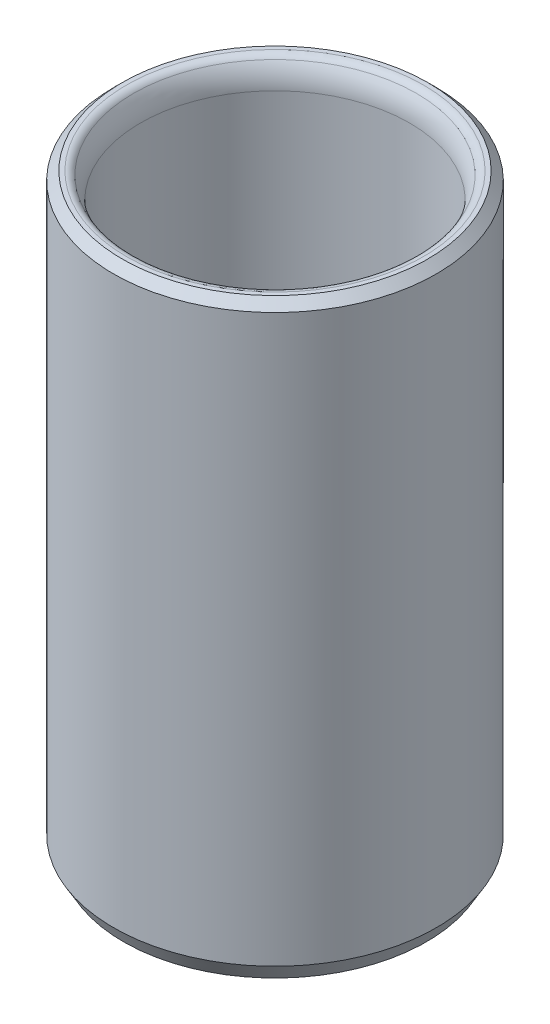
ISO-10303-21;
HEADER;
FILE_DESCRIPTION(('STEP AP214'),'2;1');
FILE_NAME('part.step','',(''),(''),'','','');
FILE_SCHEMA(('AUTOMOTIVE_DESIGN { 1 0 10303 214 1 1 1 1 }'));
ENDSEC;
DATA;
#1=APPLICATION_CONTEXT('core data for automotive mechanical design processes');
#2=APPLICATION_PROTOCOL_DEFINITION('international standard','automotive_design',2000,#1);
#3=PRODUCT_CONTEXT('',#1,'mechanical');
#4=PRODUCT('Part','Part','',(#3));
#5=PRODUCT_RELATED_PRODUCT_CATEGORY('part','',(#4));
#6=PRODUCT_DEFINITION_FORMATION('','',#4);
#7=PRODUCT_DEFINITION_CONTEXT('part definition',#1,'design');
#8=PRODUCT_DEFINITION('design','',#6,#7);
#9=PRODUCT_DEFINITION_SHAPE('','',#8);
#10=(LENGTH_UNIT() NAMED_UNIT(*) SI_UNIT(.MILLI.,.METRE.));
#11=(NAMED_UNIT(*) PLANE_ANGLE_UNIT() SI_UNIT($,.RADIAN.));
#12=(NAMED_UNIT(*) SI_UNIT($,.STERADIAN.) SOLID_ANGLE_UNIT());
#13=UNCERTAINTY_MEASURE_WITH_UNIT(LENGTH_MEASURE(1.E-05),#10,'distance_accuracy_value','');
#14=(GEOMETRIC_REPRESENTATION_CONTEXT(3) GLOBAL_UNCERTAINTY_ASSIGNED_CONTEXT((#13)) GLOBAL_UNIT_ASSIGNED_CONTEXT((#10,
#11,#12)) REPRESENTATION_CONTEXT('',''));
#15=CARTESIAN_POINT('',(0.,0.,0.));
#16=DIRECTION('',(0.,0.,1.));
#17=DIRECTION('',(1.,0.,0.));
#18=AXIS2_PLACEMENT_3D('',#15,#16,#17);
#19=CARTESIAN_POINT('',(7.4295,-22.987,0.));
#20=DIRECTION('',(0.,1.,0.));
#21=DIRECTION('',(0.,0.,1.));
#22=AXIS2_PLACEMENT_3D('',#19,#20,#21);
#23=PLANE('',#22);
#24=CARTESIAN_POINT('',(0.,-22.987,0.));
#25=DIRECTION('',(0.,1.,0.));
#26=DIRECTION('',(0.,0.,1.));
#27=AXIS2_PLACEMENT_3D('',#24,#25,#26);
#28=CIRCLE('',#27,3.3147);
#29=CARTESIAN_POINT('',(0.,-22.987,3.3147));
#30=VERTEX_POINT('',#29);
#31=EDGE_CURVE('E118',#30,#30,#28,.T.);
#32=ORIENTED_EDGE('',*,*,#31,.F.);
#33=EDGE_LOOP('',(#32));
#34=FACE_BOUND('',#33,.T.);
#35=CARTESIAN_POINT('',(0.,-22.987,0.));
#36=DIRECTION('',(0.,-1.,0.));
#37=DIRECTION('',(0.,0.,-1.));
#38=AXIS2_PLACEMENT_3D('',#35,#36,#37);
#39=CIRCLE('',#38,7.4295);
#40=CARTESIAN_POINT('',(0.,-22.987,-7.4295));
#41=VERTEX_POINT('',#40);
#42=EDGE_CURVE('E52',#41,#41,#39,.T.);
#43=ORIENTED_EDGE('',*,*,#42,.F.);
#44=EDGE_LOOP('',(#43));
#45=FACE_BOUND('',#44,.T.);
#46=ADVANCED_FACE('F39',(#34,#45),#23,.T.);
#47=CARTESIAN_POINT('',(0.,-22.479,0.));
#48=DIRECTION('',(0.,-1.,0.));
#49=DIRECTION('',(0.,0.,-1.));
#50=AXIS2_PLACEMENT_3D('',#47,#48,#49);
#51=TOROIDAL_SURFACE('',#50,7.4295,0.507999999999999);
#52=ORIENTED_EDGE('',*,*,#42,.T.);
#53=EDGE_LOOP('',(#52));
#54=FACE_BOUND('',#53,.T.);
#55=CARTESIAN_POINT('',(0.,-22.479,0.));
#56=DIRECTION('',(0.,-1.,0.));
#57=DIRECTION('',(0.,0.,-1.));
#58=AXIS2_PLACEMENT_3D('',#55,#56,#57);
#59=CIRCLE('',#58,7.9375);
#60=CARTESIAN_POINT('',(0.,-22.479,-7.9375));
#61=VERTEX_POINT('',#60);
#62=EDGE_CURVE('E102',#61,#61,#59,.T.);
#63=ORIENTED_EDGE('',*,*,#62,.F.);
#64=EDGE_LOOP('',(#63));
#65=FACE_BOUND('',#64,.T.);
#66=ADVANCED_FACE('F107',(#54,#65),#51,.F.);
#67=CARTESIAN_POINT('',(0.,-34.925,0.));
#68=DIRECTION('',(0.,-1.,0.));
#69=DIRECTION('',(0.,0.,-1.));
#70=AXIS2_PLACEMENT_3D('',#67,#68,#69);
#71=CYLINDRICAL_SURFACE('',#70,7.9375);
#72=CARTESIAN_POINT('',(-7.8977127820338,-19.05,0.793749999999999));
#73=CARTESIAN_POINT('',(-7.89771330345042,-19.0944655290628,0.793748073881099));
#74=CARTESIAN_POINT('',(-7.89809235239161,-19.1389604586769,0.790001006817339));
#75=CARTESIAN_POINT('',(-7.89956738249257,-19.2267166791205,0.775109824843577));
#76=CARTESIAN_POINT('',(-7.90066415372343,-19.2699765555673,0.763957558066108));
#77=CARTESIAN_POINT('',(-7.90344918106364,-19.3539791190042,0.73458396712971));
#78=CARTESIAN_POINT('',(-7.90513707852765,-19.3947233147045,0.716366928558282));
#79=CARTESIAN_POINT('',(-7.90891373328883,-19.4725669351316,0.673389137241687));
#80=CARTESIAN_POINT('',(-7.91100241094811,-19.5096670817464,0.648629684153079));
#81=CARTESIAN_POINT('',(-7.91535379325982,-19.5793131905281,0.593173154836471));
#82=CARTESIAN_POINT('',(-7.9176170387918,-19.6118440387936,0.562457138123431));
#83=CARTESIAN_POINT('',(-7.92205763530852,-19.6712979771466,0.495999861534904));
#84=CARTESIAN_POINT('',(-7.92423498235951,-19.6982208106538,0.460258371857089));
#85=CARTESIAN_POINT('',(-7.92826379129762,-19.7457466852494,0.384672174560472));
#86=CARTESIAN_POINT('',(-7.93011456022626,-19.7663363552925,0.344819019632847));
#87=CARTESIAN_POINT('',(-7.93327579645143,-19.8005258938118,0.262199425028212));
#88=CARTESIAN_POINT('',(-7.93458627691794,-19.8141259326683,0.219433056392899));
#89=CARTESIAN_POINT('',(-7.93651548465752,-19.8339058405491,0.132353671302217));
#90=CARTESIAN_POINT('',(-7.93713652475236,-19.8401105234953,0.0880463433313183));
#91=CARTESIAN_POINT('',(-7.93762474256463,-19.8450003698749,-0.000984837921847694));
#92=CARTESIAN_POINT('',(-7.9374919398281,-19.8436857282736,-0.0457086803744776));
#93=CARTESIAN_POINT('',(-7.93648932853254,-19.8335943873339,-0.134134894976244));
#94=CARTESIAN_POINT('',(-7.93562215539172,-19.8248443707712,-0.177840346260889));
#95=CARTESIAN_POINT('',(-7.93325128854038,-19.8001722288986,-0.263159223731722));
#96=CARTESIAN_POINT('',(-7.93174758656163,-19.7842500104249,-0.304772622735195));
#97=CARTESIAN_POINT('',(-7.92826819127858,-19.7456561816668,-0.38481024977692));
#98=CARTESIAN_POINT('',(-7.9262916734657,-19.7229727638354,-0.423228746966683));
#99=CARTESIAN_POINT('',(-7.9220884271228,-19.6715090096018,-0.495723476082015));
#100=CARTESIAN_POINT('',(-7.91986169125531,-19.6427284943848,-0.529799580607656));
#101=CARTESIAN_POINT('',(-7.91539639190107,-19.5797374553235,-0.592798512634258));
#102=CARTESIAN_POINT('',(-7.91315781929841,-19.5455037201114,-0.621698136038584));
#103=CARTESIAN_POINT('',(-7.90893087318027,-19.4726584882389,-0.673344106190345));
#104=CARTESIAN_POINT('',(-7.90694250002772,-19.4340469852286,-0.696090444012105));
#105=CARTESIAN_POINT('',(-7.90344089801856,-19.3535244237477,-0.734784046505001));
#106=CARTESIAN_POINT('',(-7.90192776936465,-19.3116126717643,-0.750729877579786));
#107=CARTESIAN_POINT('',(-7.89955003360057,-19.2256881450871,-0.775351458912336));
#108=CARTESIAN_POINT('',(-7.89868540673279,-19.1816754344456,-0.784027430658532));
#109=CARTESIAN_POINT('',(-7.89770598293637,-19.0930020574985,-0.793833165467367));
#110=CARTESIAN_POINT('',(-7.8975879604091,-19.0483450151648,-0.794995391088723));
#111=CARTESIAN_POINT('',(-7.8981065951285,-18.9594718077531,-0.789825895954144));
#112=CARTESIAN_POINT('',(-7.89874324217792,-18.9152556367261,-0.783494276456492));
#113=CARTESIAN_POINT('',(-7.90069654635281,-18.8286139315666,-0.763543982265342));
#114=CARTESIAN_POINT('',(-7.90201177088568,-18.7861848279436,-0.749940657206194));
#115=CARTESIAN_POINT('',(-7.90517287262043,-18.7042107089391,-0.715848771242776));
#116=CARTESIAN_POINT('',(-7.90701876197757,-18.6646657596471,-0.695360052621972));
#117=CARTESIAN_POINT('',(-7.91104101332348,-18.5894345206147,-0.647997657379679));
#118=CARTESIAN_POINT('',(-7.91321847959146,-18.5537618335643,-0.621102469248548));
#119=CARTESIAN_POINT('',(-7.91765492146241,-18.4874256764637,-0.56172142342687));
#120=CARTESIAN_POINT('',(-7.9199138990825,-18.4567623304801,-0.529235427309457));
#121=CARTESIAN_POINT('',(-7.92426856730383,-18.4012033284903,-0.459454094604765));
#122=CARTESIAN_POINT('',(-7.92636364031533,-18.3763288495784,-0.422141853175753));
#123=CARTESIAN_POINT('',(-7.93014544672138,-18.333199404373,-0.343850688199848));
#124=CARTESIAN_POINT('',(-7.93183218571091,-18.3149443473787,-0.302871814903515));
#125=CARTESIAN_POINT('',(-7.93460448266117,-18.2856078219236,-0.218484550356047));
#126=CARTESIAN_POINT('',(-7.93569111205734,-18.2745135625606,-0.175080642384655));
#127=CARTESIAN_POINT('',(-7.93714515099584,-18.259771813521,-0.0870146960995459));
#128=CARTESIAN_POINT('',(-7.93751258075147,-18.2561241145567,-0.0423526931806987));
#129=CARTESIAN_POINT('',(-7.93748681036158,-18.2563819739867,0.0467536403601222));
#130=CARTESIAN_POINT('',(-7.93709692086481,-18.2602546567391,0.0911980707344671));
#131=CARTESIAN_POINT('',(-7.93560685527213,-18.2753744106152,0.178801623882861));
#132=CARTESIAN_POINT('',(-7.93450667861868,-18.2866214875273,0.221960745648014));
#133=CARTESIAN_POINT('',(-7.93171930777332,-18.3161616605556,0.305768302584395));
#134=CARTESIAN_POINT('',(-7.93003219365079,-18.334453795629,0.346417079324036));
#135=CARTESIAN_POINT('',(-7.92625901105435,-18.3775613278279,0.424072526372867));
#136=CARTESIAN_POINT('',(-7.92417294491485,-18.4023766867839,0.461079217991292));
#137=CARTESIAN_POINT('',(-7.91982465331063,-18.4579495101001,0.530568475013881));
#138=CARTESIAN_POINT('',(-7.9175617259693,-18.4887314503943,0.5630314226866));
#139=CARTESIAN_POINT('',(-7.91312068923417,-18.5553154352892,0.622345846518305));
#140=CARTESIAN_POINT('',(-7.91094260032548,-18.591118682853,0.649195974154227));
#141=CARTESIAN_POINT('',(-7.90691191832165,-18.6668285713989,0.69657645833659));
#142=CARTESIAN_POINT('',(-7.90506016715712,-18.706745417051,0.717090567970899));
#143=CARTESIAN_POINT('',(-7.90190185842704,-18.7894502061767,0.751097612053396));
#144=CARTESIAN_POINT('',(-7.90059468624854,-18.832234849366,0.764598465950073));
#145=CARTESIAN_POINT('',(-7.89900318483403,-18.9043847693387,0.780829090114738));
#146=CARTESIAN_POINT('',(-7.89852157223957,-18.9332887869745,0.78566780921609));
#147=CARTESIAN_POINT('',(-7.8978761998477,-18.99145762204,0.792128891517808));
#148=CARTESIAN_POINT('',(-7.897712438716,-19.0207224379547,0.793751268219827));
#149=CARTESIAN_POINT('',(-7.8977127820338,-19.05,0.793749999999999));
#150=B_SPLINE_CURVE_WITH_KNOTS('',3,(#72,#73,#74,#75,#76,#77,#78,#79,#80,#81,#82,#83,#84,#85,
#86,#87,#88,#89,#90,#91,#92,#93,#94,#95,#96,#97,#98,#99,#100,#101,#102,#103,#104,#105,#106,#107,
#108,#109,#110,#111,#112,#113,#114,#115,#116,#117,#118,#119,#120,#121,#122,#123,#124,#125,#126,
#127,#128,#129,#130,#131,#132,#133,#134,#135,#136,#137,#138,#139,#140,#141,#142,#143,#144,#145,
#146,#147,#148,#149),.UNSPECIFIED.,.T.,.F.,(4,2,2,2,2,2,2,2,2,2,2,2,2,2,2,2,2,2,2,2,2,2,2,2,2,2,
2,2,2,2,2,2,2,2,2,2,2,2,4),(0.,0.133289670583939,0.266726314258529,0.40008213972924,
0.533411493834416,0.667171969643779,0.800938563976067,0.934985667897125,1.06902950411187,
1.20262230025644,1.33621163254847,1.46932357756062,1.60243725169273,1.73578476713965,
1.86913619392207,2.00307118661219,2.13700637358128,2.2709697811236,2.40492910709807,
2.53830928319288,2.67168765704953,2.80478559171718,2.93788657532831,3.07144094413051,
3.20499862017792,3.33903746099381,3.47307446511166,3.60687137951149,3.74066453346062,
3.87387412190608,4.00708381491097,4.14027534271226,4.27346609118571,4.40721523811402,
4.54099648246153,4.6751179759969,4.80908768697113,4.89685034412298,4.98461263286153),.UNSPECIFIED.);
#151=CARTESIAN_POINT('',(-7.8977127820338,-19.05,0.793749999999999));
#152=VERTEX_POINT('',#151);
#153=EDGE_CURVE('E154',#152,#152,#150,.T.);
#154=ORIENTED_EDGE('',*,*,#153,.F.);
#155=EDGE_LOOP('',(#154));
#156=FACE_BOUND('',#155,.T.);
#157=ORIENTED_EDGE('',*,*,#62,.T.);
#158=EDGE_LOOP('',(#157));
#159=FACE_BOUND('',#158,.T.);
#160=CARTESIAN_POINT('',(0.,-1.524,0.));
#161=DIRECTION('',(0.,-1.,0.));
#162=DIRECTION('',(0.,0.,-1.));
#163=AXIS2_PLACEMENT_3D('',#160,#161,#162);
#164=CIRCLE('',#163,7.9375);
#165=CARTESIAN_POINT('',(0.,-1.524,-7.9375));
#166=VERTEX_POINT('',#165);
#167=EDGE_CURVE('E99',#166,#166,#164,.T.);
#168=ORIENTED_EDGE('',*,*,#167,.F.);
#169=EDGE_LOOP('',(#168));
#170=FACE_BOUND('',#169,.T.);
#171=ADVANCED_FACE('F115',(#156,#159,#170),#71,.F.);
#172=CARTESIAN_POINT('',(0.,-1.524,0.));
#173=DIRECTION('',(0.,-1.,0.));
#174=DIRECTION('',(0.,0.,-1.));
#175=AXIS2_PLACEMENT_3D('',#172,#173,#174);
#176=TOROIDAL_SURFACE('',#175,10.2235,2.286);
#177=ORIENTED_EDGE('',*,*,#167,.T.);
#178=EDGE_LOOP('',(#177));
#179=FACE_BOUND('',#178,.T.);
#180=CARTESIAN_POINT('',(0.,-0.217714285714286,0.));
#181=DIRECTION('',(0.,-1.,0.));
#182=DIRECTION('',(0.,0.,-1.));
#183=AXIS2_PLACEMENT_3D('',#180,#181,#182);
#184=CIRCLE('',#183,8.34748997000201);
#185=CARTESIAN_POINT('',(0.,-0.217714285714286,-8.34748997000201));
#186=VERTEX_POINT('',#185);
#187=EDGE_CURVE('E96',#186,#186,#184,.T.);
#188=ORIENTED_EDGE('',*,*,#187,.F.);
#189=EDGE_LOOP('',(#188));
#190=FACE_BOUND('',#189,.T.);
#191=ADVANCED_FACE('F145',(#179,#190),#176,.T.);
#192=CARTESIAN_POINT('',(0.,-0.508,0.));
#193=DIRECTION('',(0.,-1.,0.));
#194=DIRECTION('',(0.,0.,-1.));
#195=AXIS2_PLACEMENT_3D('',#192,#193,#194);
#196=TOROIDAL_SURFACE('',#195,8.76438108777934,0.508);
#197=ORIENTED_EDGE('',*,*,#187,.T.);
#198=EDGE_LOOP('',(#197));
#199=FACE_BOUND('',#198,.T.);
#200=CARTESIAN_POINT('',(0.,0.,0.));
#201=DIRECTION('',(0.,-1.,0.));
#202=DIRECTION('',(0.,0.,-1.));
#203=AXIS2_PLACEMENT_3D('',#200,#201,#202);
#204=CIRCLE('',#203,8.76438108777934);
#205=CARTESIAN_POINT('',(0.,0.,-8.76438108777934));
#206=VERTEX_POINT('',#205);
#207=EDGE_CURVE('E93',#206,#206,#204,.T.);
#208=ORIENTED_EDGE('',*,*,#207,.F.);
#209=EDGE_LOOP('',(#208));
#210=FACE_BOUND('',#209,.T.);
#211=ADVANCED_FACE('F141',(#199,#210),#196,.T.);
#212=CARTESIAN_POINT('',(9.017,0.,0.));
#213=DIRECTION('',(0.,1.,0.));
#214=DIRECTION('',(0.,0.,1.));
#215=AXIS2_PLACEMENT_3D('',#212,#213,#214);
#216=PLANE('',#215);
#217=ORIENTED_EDGE('',*,*,#207,.T.);
#218=EDGE_LOOP('',(#217));
#219=FACE_BOUND('',#218,.T.);
#220=CARTESIAN_POINT('',(0.,0.,0.));
#221=DIRECTION('',(0.,-1.,0.));
#222=DIRECTION('',(0.,0.,-1.));
#223=AXIS2_PLACEMENT_3D('',#220,#221,#222);
#224=CIRCLE('',#223,9.017);
#225=CARTESIAN_POINT('',(0.,0.,-9.017));
#226=VERTEX_POINT('',#225);
#227=EDGE_CURVE('E84',#226,#226,#224,.T.);
#228=ORIENTED_EDGE('',*,*,#227,.F.);
#229=EDGE_LOOP('',(#228));
#230=FACE_BOUND('',#229,.T.);
#231=ADVANCED_FACE('F137',(#219,#230),#216,.T.);
#232=CARTESIAN_POINT('',(0.,-0.508000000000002,0.));
#233=DIRECTION('',(0.,-1.,0.));
#234=DIRECTION('',(0.,0.,-1.));
#235=AXIS2_PLACEMENT_3D('',#232,#233,#234);
#236=CONICAL_SURFACE('',#235,9.525,0.785398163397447);
#237=CARTESIAN_POINT('',(-9.398,-1.57800252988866,-4.89200108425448));
#238=CARTESIAN_POINT('',(-9.398,-1.44130417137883,-4.59583735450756));
#239=CARTESIAN_POINT('',(-9.398,-1.31245979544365,-4.29573791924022));
#240=CARTESIAN_POINT('',(-9.398,-1.07440407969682,-3.68687240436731));
#241=CARTESIAN_POINT('',(-9.398,-0.96525192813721,-3.37808331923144));
#242=CARTESIAN_POINT('',(-9.398,-0.772140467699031,-2.75529660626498));
#243=CARTESIAN_POINT('',(-9.398,-0.687986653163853,-2.44136038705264));
#244=CARTESIAN_POINT('',(-9.398,-0.548252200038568,-1.80746181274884));
#245=CARTESIAN_POINT('',(-9.398,-0.492636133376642,-1.48750744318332));
#246=CARTESIAN_POINT('',(-9.398,-0.424372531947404,-0.933006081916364));
#247=CARTESIAN_POINT('',(-9.398,-0.404085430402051,-0.699386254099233));
#248=CARTESIAN_POINT('',(-9.398,-0.380938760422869,-0.231234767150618));
#249=CARTESIAN_POINT('',(-9.398,-0.37808129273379,0.00329699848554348));
#250=CARTESIAN_POINT('',(-9.398,-0.389932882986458,0.472224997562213));
#251=CARTESIAN_POINT('',(-9.398,-0.404665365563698,0.706620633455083));
#252=CARTESIAN_POINT('',(-9.398,-0.451148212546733,1.17365620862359));
#253=CARTESIAN_POINT('',(-9.398,-0.482896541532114,1.40629635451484));
#254=CARTESIAN_POINT('',(-9.398,-0.583560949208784,1.99261384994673));
#255=CARTESIAN_POINT('',(-9.398,-0.663274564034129,2.34446045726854));
#256=CARTESIAN_POINT('',(-9.398,-0.854677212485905,3.03970183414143));
#257=CARTESIAN_POINT('',(-9.398,-0.966416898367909,3.38308227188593));
#258=CARTESIAN_POINT('',(-9.398,-1.21608800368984,4.06120786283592));
#259=CARTESIAN_POINT('',(-9.398,-1.35409450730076,4.39592505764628));
#260=CARTESIAN_POINT('',(-9.398,-1.57622602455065,4.89035726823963));
#261=CARTESIAN_POINT('',(-9.398,-1.65264159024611,5.05361178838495));
#262=CARTESIAN_POINT('',(-9.398,-1.80999560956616,5.37786916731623));
#263=CARTESIAN_POINT('',(-9.398,-1.89093270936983,5.53887268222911));
#264=CARTESIAN_POINT('',(-9.398,-1.97386924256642,5.6988422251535));
#265=B_SPLINE_CURVE_WITH_KNOTS('',3,(#237,#238,#239,#240,#241,#242,#243,#244,#245,#246,#247,
#248,#249,#250,#251,#252,#253,#254,#255,#256,#257,#258,#259,#260,#261,#262,#263,#264),
.UNSPECIFIED.,.F.,.F.,(4,2,2,2,2,2,2,2,2,2,2,2,2,4),(0.,0.978878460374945,1.96065178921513,
2.93457308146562,3.90728235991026,4.61017857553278,5.31315950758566,6.01707764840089,
6.72091160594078,7.80128693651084,8.88338050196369,9.96861501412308,10.5093212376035,
11.0498664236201),.UNSPECIFIED.);
#266=CARTESIAN_POINT('',(-9.398,-0.508000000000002,1.55023256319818));
#267=VERTEX_POINT('',#266);
#268=CARTESIAN_POINT('',(-9.398,-0.508000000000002,-1.55023256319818));
#269=VERTEX_POINT('',#268);
#270=EDGE_CURVE('E78',#267,#269,#265,.F.);
#271=ORIENTED_EDGE('',*,*,#270,.F.);
#272=CARTESIAN_POINT('',(0.,-0.508000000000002,0.));
#273=DIRECTION('',(0.,-1.,0.));
#274=DIRECTION('',(0.,0.,-1.));
#275=AXIS2_PLACEMENT_3D('',#272,#273,#274);
#276=CIRCLE('',#275,9.525);
#277=EDGE_CURVE('E77',#269,#267,#276,.T.);
#278=ORIENTED_EDGE('',*,*,#277,.F.);
#279=EDGE_LOOP('',(#271,#278));
#280=FACE_BOUND('',#279,.T.);
#281=ORIENTED_EDGE('',*,*,#227,.T.);
#282=EDGE_LOOP('',(#281));
#283=FACE_BOUND('',#282,.T.);
#284=ADVANCED_FACE('F132',(#280,#283),#236,.T.);
#285=CARTESIAN_POINT('',(0.,-34.925,0.));
#286=DIRECTION('',(0.,-1.,0.));
#287=DIRECTION('',(0.,0.,-1.));
#288=AXIS2_PLACEMENT_3D('',#285,#286,#287);
#289=CYLINDRICAL_SURFACE('',#288,9.525);
#290=DIRECTION('',(0.,-1.,0.));
#291=VECTOR('',#290,1.);
#292=CARTESIAN_POINT('',(-9.398,-34.925,1.55023256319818));
#293=LINE('',#292,#291);
#294=CARTESIAN_POINT('',(-9.398,-33.909,1.55023256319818));
#295=VERTEX_POINT('',#294);
#296=EDGE_CURVE('E63',#295,#267,#293,.F.);
#297=ORIENTED_EDGE('',*,*,#296,.F.);
#298=CARTESIAN_POINT('',(0.,-33.909,0.));
#299=DIRECTION('',(0.,-1.,0.));
#300=DIRECTION('',(0.,0.,-1.));
#301=AXIS2_PLACEMENT_3D('',#298,#299,#300);
#302=CIRCLE('',#301,9.525);
#303=CARTESIAN_POINT('',(-9.398,-33.909,-1.55023256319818));
#304=VERTEX_POINT('',#303);
#305=EDGE_CURVE('E75',#304,#295,#302,.T.);
#306=ORIENTED_EDGE('',*,*,#305,.F.);
#307=DIRECTION('',(0.,-1.,0.));
#308=VECTOR('',#307,1.);
#309=CARTESIAN_POINT('',(-9.398,-34.925,-1.55023256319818));
#310=LINE('',#309,#308);
#311=EDGE_CURVE('E58',#269,#304,#310,.T.);
#312=ORIENTED_EDGE('',*,*,#311,.F.);
#313=ORIENTED_EDGE('',*,*,#277,.T.);
#314=EDGE_LOOP('',(#297,#306,#312,#313));
#315=FACE_BOUND('',#314,.T.);
#316=ADVANCED_FACE('F74',(#315),#289,.T.);
#317=CARTESIAN_POINT('',(0.,-34.925,0.));
#318=DIRECTION('',(0.,1.,0.));
#319=DIRECTION('',(0.,0.,1.));
#320=AXIS2_PLACEMENT_3D('',#317,#318,#319);
#321=CONICAL_SURFACE('',#320,8.93841212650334,0.523598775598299);
#322=CARTESIAN_POINT('',(-9.398,-32.9660891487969,-3.61527421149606));
#323=CARTESIAN_POINT('',(-9.398,-33.0856723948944,-3.42289413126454));
#324=CARTESIAN_POINT('',(-9.398,-33.1994578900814,-3.22662518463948));
#325=CARTESIAN_POINT('',(-9.398,-33.4125171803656,-2.82537472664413));
#326=CARTESIAN_POINT('',(-9.398,-33.5117297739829,-2.62036088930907));
#327=CARTESIAN_POINT('',(-9.398,-33.6923505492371,-2.20073198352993));
#328=CARTESIAN_POINT('',(-9.398,-33.7736236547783,-1.98605781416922));
#329=CARTESIAN_POINT('',(-9.398,-33.9133303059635,-1.54965066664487));
#330=CARTESIAN_POINT('',(-9.398,-33.9718020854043,-1.32793018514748));
#331=CARTESIAN_POINT('',(-9.398,-34.0497326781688,-0.942181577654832));
#332=CARTESIAN_POINT('',(-9.398,-34.0755349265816,-0.779425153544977));
#333=CARTESIAN_POINT('',(-9.398,-34.1125872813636,-0.452221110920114));
#334=CARTESIAN_POINT('',(-9.398,-34.1238362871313,-0.287773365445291));
#335=CARTESIAN_POINT('',(-9.398,-34.131283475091,0.040319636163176));
#336=CARTESIAN_POINT('',(-9.398,-34.1275855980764,0.203962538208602));
#337=CARTESIAN_POINT('',(-9.398,-34.1055275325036,0.530245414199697));
#338=CARTESIAN_POINT('',(-9.398,-34.0871675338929,0.692885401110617));
#339=CARTESIAN_POINT('',(-9.398,-34.0366659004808,1.01492929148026));
#340=CARTESIAN_POINT('',(-9.398,-34.0046125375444,1.17434718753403));
#341=CARTESIAN_POINT('',(-9.398,-33.9278526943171,1.4901142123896));
#342=CARTESIAN_POINT('',(-9.398,-33.8831434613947,1.64646266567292));
#343=CARTESIAN_POINT('',(-9.398,-33.7819637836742,1.95685067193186));
#344=CARTESIAN_POINT('',(-9.398,-33.7253902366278,2.11085637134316));
#345=CARTESIAN_POINT('',(-9.398,-33.6021836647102,2.41473548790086));
#346=CARTESIAN_POINT('',(-9.398,-33.5355513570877,2.56460919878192));
#347=CARTESIAN_POINT('',(-9.398,-33.3294015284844,2.99384596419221));
#348=CARTESIAN_POINT('',(-9.398,-33.1784632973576,3.2677449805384));
#349=CARTESIAN_POINT('',(-9.398,-32.8530249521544,3.80153638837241));
#350=CARTESIAN_POINT('',(-9.398,-32.6784799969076,4.06140077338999));
#351=CARTESIAN_POINT('',(-9.398,-32.3170954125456,4.56143452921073));
#352=CARTESIAN_POINT('',(-9.398,-32.130731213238,4.80195028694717));
#353=CARTESIAN_POINT('',(-9.398,-31.8422756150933,5.1544688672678));
#354=CARTESIAN_POINT('',(-9.398,-31.7448608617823,5.27035550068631));
#355=CARTESIAN_POINT('',(-9.398,-31.547321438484,5.49975016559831));
#356=CARTESIAN_POINT('',(-9.398,-31.4471974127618,5.61325875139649));
#357=CARTESIAN_POINT('',(-9.398,-31.3458816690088,5.72569598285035));
#358=B_SPLINE_CURVE_WITH_KNOTS('',3,(#322,#323,#324,#325,#326,#327,#328,#329,#330,#331,#332,
#333,#334,#335,#336,#337,#338,#339,#340,#341,#342,#343,#344,#345,#346,#347,#348,#349,#350,#351,
#352,#353,#354,#355,#356,#357),.UNSPECIFIED.,.F.,.F.,(4,2,2,2,2,2,2,2,2,2,2,2,2,2,2,2,2,4),(0.,
0.679812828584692,1.36240367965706,2.04997095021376,2.73638028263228,3.23015525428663,
3.72396756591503,4.2143518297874,4.70472974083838,5.19199311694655,5.67936255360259,
6.17115715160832,6.66291669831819,7.59937701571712,8.53764180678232,9.44987649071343,
9.90401800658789,10.3580524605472),.UNSPECIFIED.);
#359=EDGE_CURVE('E11',#304,#295,#358,.T.);
#360=ORIENTED_EDGE('',*,*,#359,.F.);
#361=ORIENTED_EDGE('',*,*,#305,.T.);
#362=EDGE_LOOP('',(#360,#361));
#363=FACE_BOUND('',#362,.T.);
#364=CARTESIAN_POINT('',(0.,-34.925,0.));
#365=DIRECTION('',(0.,-1.,0.));
#366=DIRECTION('',(0.,0.,-1.));
#367=AXIS2_PLACEMENT_3D('',#364,#365,#366);
#368=CIRCLE('',#367,8.93841212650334);
#369=CARTESIAN_POINT('',(0.,-34.925,-8.93841212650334));
#370=VERTEX_POINT('',#369);
#371=EDGE_CURVE('E82',#370,#370,#368,.T.);
#372=ORIENTED_EDGE('',*,*,#371,.F.);
#373=EDGE_LOOP('',(#372));
#374=FACE_BOUND('',#373,.T.);
#375=ADVANCED_FACE('F80',(#363,#374),#321,.T.);
#376=CARTESIAN_POINT('',(0.,-34.925,0.));
#377=DIRECTION('',(0.,-1.,0.));
#378=DIRECTION('',(0.,0.,-1.));
#379=AXIS2_PLACEMENT_3D('',#376,#377,#378);
#380=PLANE('',#379);
#381=CARTESIAN_POINT('',(0.,-34.925,0.));
#382=DIRECTION('',(0.,-1.,0.));
#383=DIRECTION('',(0.,0.,-1.));
#384=AXIS2_PLACEMENT_3D('',#381,#382,#383);
#385=CIRCLE('',#384,3.3147);
#386=CARTESIAN_POINT('',(0.,-34.925,-3.3147));
#387=VERTEX_POINT('',#386);
#388=EDGE_CURVE('E87',#387,#387,#385,.T.);
#389=ORIENTED_EDGE('',*,*,#388,.F.);
#390=EDGE_LOOP('',(#389));
#391=FACE_BOUND('',#390,.T.);
#392=ORIENTED_EDGE('',*,*,#371,.T.);
#393=EDGE_LOOP('',(#392));
#394=FACE_BOUND('',#393,.T.);
#395=ADVANCED_FACE('F188',(#391,#394),#380,.T.);
#396=CARTESIAN_POINT('',(0.,-22.987,0.));
#397=DIRECTION('',(0.,1.,0.));
#398=DIRECTION('',(0.,0.,1.));
#399=AXIS2_PLACEMENT_3D('',#396,#397,#398);
#400=CYLINDRICAL_SURFACE('',#399,3.3147);
#401=ORIENTED_EDGE('',*,*,#388,.T.);
#402=EDGE_LOOP('',(#401));
#403=FACE_BOUND('',#402,.T.);
#404=ORIENTED_EDGE('',*,*,#31,.T.);
#405=EDGE_LOOP('',(#404));
#406=FACE_BOUND('',#405,.T.);
#407=ADVANCED_FACE('F168',(#403,#406),#400,.F.);
#408=CARTESIAN_POINT('',(-9.398,-34.925,-1.5875));
#409=DIRECTION('',(1.,0.,0.));
#410=DIRECTION('',(0.,0.,-1.));
#411=AXIS2_PLACEMENT_3D('',#408,#409,#410);
#412=PLANE('',#411);
#413=CARTESIAN_POINT('',(-9.398,-19.05,0.));
#414=DIRECTION('',(-1.,0.,0.));
#415=DIRECTION('',(0.,0.,1.));
#416=AXIS2_PLACEMENT_3D('',#413,#414,#415);
#417=CIRCLE('',#416,0.793749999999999);
#418=CARTESIAN_POINT('',(-9.398,-19.05,0.793749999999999));
#419=VERTEX_POINT('',#418);
#420=EDGE_CURVE('E160',#419,#419,#417,.T.);
#421=ORIENTED_EDGE('',*,*,#420,.F.);
#422=EDGE_LOOP('',(#421));
#423=FACE_BOUND('',#422,.T.);
#424=ORIENTED_EDGE('',*,*,#270,.T.);
#425=ORIENTED_EDGE('',*,*,#311,.T.);
#426=ORIENTED_EDGE('',*,*,#359,.T.);
#427=ORIENTED_EDGE('',*,*,#296,.T.);
#428=EDGE_LOOP('',(#424,#425,#426,#427));
#429=FACE_BOUND('',#428,.T.);
#430=ADVANCED_FACE('F68',(#423,#429),#412,.F.);
#431=CARTESIAN_POINT('',(-6.858,-19.05,0.));
#432=DIRECTION('',(-1.,0.,0.));
#433=DIRECTION('',(0.,0.,1.));
#434=AXIS2_PLACEMENT_3D('',#431,#432,#433);
#435=CYLINDRICAL_SURFACE('',#434,0.793749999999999);
#436=ORIENTED_EDGE('',*,*,#153,.T.);
#437=EDGE_LOOP('',(#436));
#438=FACE_BOUND('',#437,.T.);
#439=ORIENTED_EDGE('',*,*,#420,.T.);
#440=EDGE_LOOP('',(#439));
#441=FACE_BOUND('',#440,.T.);
#442=ADVANCED_FACE('F161',(#438,#441),#435,.F.);
#443=CLOSED_SHELL('',(#46,#66,#171,#191,#211,#231,#284,#316,#375,#395,#407,#430,#442));
#444=MANIFOLD_SOLID_BREP('B2',#443);
#445=ADVANCED_BREP_SHAPE_REPRESENTATION('',(#18,#444),#14);
#446=SHAPE_DEFINITION_REPRESENTATION(#9,#445);
ENDSEC;
END-ISO-10303-21;
